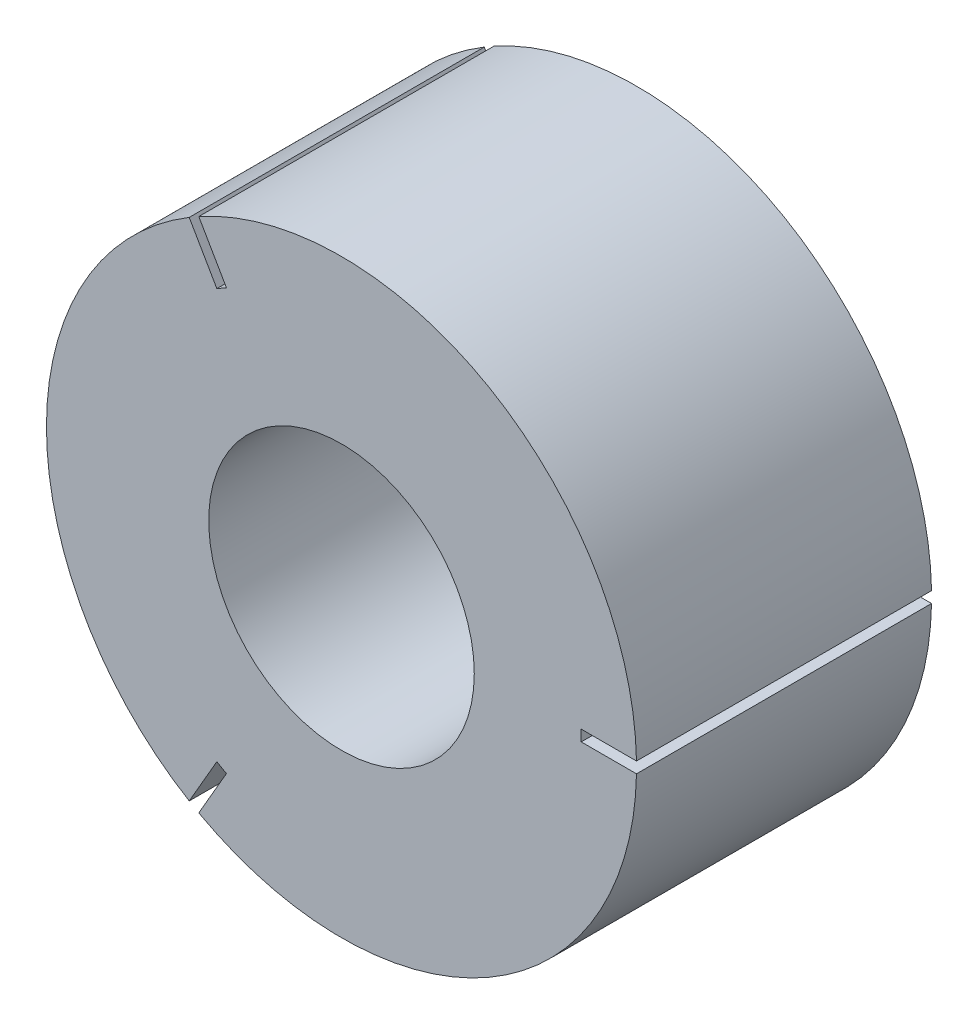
from build123d import *

# Parameters (mm, degrees)
SKETCH1_R          = 40
EXTRUDE1_DEPTH     = 40
SKETCH2_R          = 18
CUT_EXTRUDE1_DEPTH = 70.282032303
SKETCH3_W          = 7.5
SKETCH3_H          = 1.5
CUT_EXTRUDE2_DEPTH = 70.282032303
CIRPATTERN1_COUNT  = 3


with BuildPart() as part:
    # Sketch1 → Extrude1 (new body)
    with BuildSketch(Plane.XY):
        Circle(SKETCH1_R)
    extrude(amount=EXTRUDE1_DEPTH)

    # Sketch2 → Cut-Extrude1 (cut, through all)
    with BuildSketch(Plane.XY.offset(40)):
        Circle(SKETCH2_R)
    extrude(amount=-CUT_EXTRUDE1_DEPTH, mode=Mode.SUBTRACT)

    # Sketch3 → Cut-Extrude2 (cut, through all)
    with BuildSketch(Plane.XY.offset(40)):
        with Locations((36.25, 0)):
            Rectangle(SKETCH3_W, SKETCH3_H)
    cut_extrude2 = extrude(amount=-CUT_EXTRUDE2_DEPTH, mode=Mode.SUBTRACT)

    # CirPattern1: Cut-Extrude2 ×3 about axis
    cirpattern1_axis = Axis((0, 0, 0), (0, 0, 1))
    for i in range(1, CIRPATTERN1_COUNT):
        add(cut_extrude2.rotate(cirpattern1_axis, i * 360 / CIRPATTERN1_COUNT), mode=Mode.SUBTRACT)


solid = part.part
